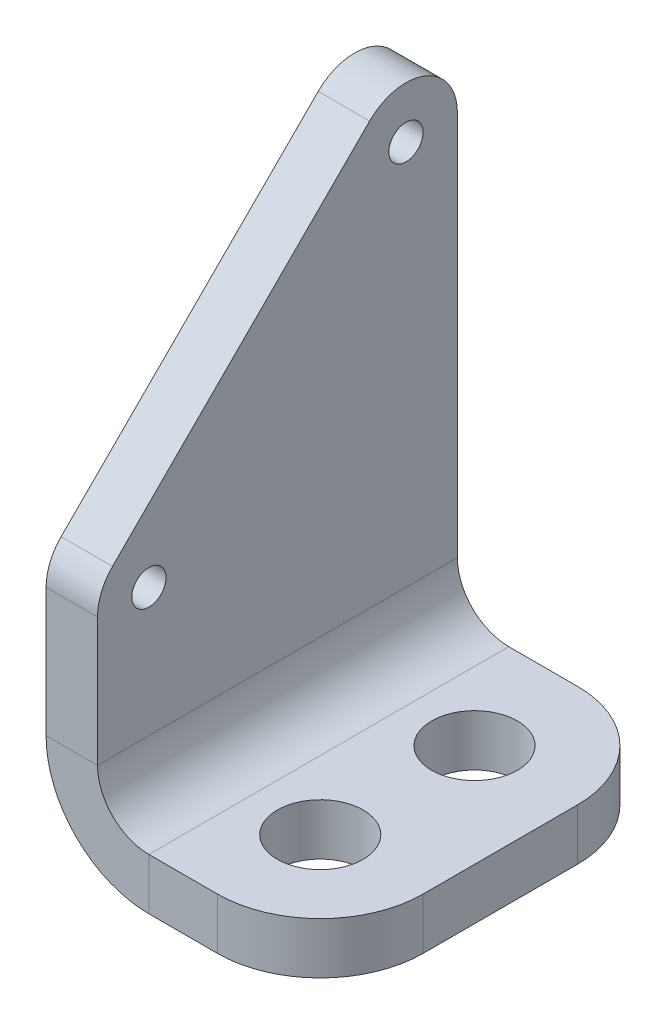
ISO-10303-21;
HEADER;
FILE_DESCRIPTION(('STEP AP214'),'2;1');
FILE_NAME('part.step','',(''),(''),'','','');
FILE_SCHEMA(('AUTOMOTIVE_DESIGN { 1 0 10303 214 1 1 1 1 }'));
ENDSEC;
DATA;
#1=APPLICATION_CONTEXT('core data for automotive mechanical design processes');
#2=APPLICATION_PROTOCOL_DEFINITION('international standard','automotive_design',2000,#1);
#3=PRODUCT_CONTEXT('',#1,'mechanical');
#4=PRODUCT('Part','Part','',(#3));
#5=PRODUCT_RELATED_PRODUCT_CATEGORY('part','',(#4));
#6=PRODUCT_DEFINITION_FORMATION('','',#4);
#7=PRODUCT_DEFINITION_CONTEXT('part definition',#1,'design');
#8=PRODUCT_DEFINITION('design','',#6,#7);
#9=PRODUCT_DEFINITION_SHAPE('','',#8);
#10=(LENGTH_UNIT() NAMED_UNIT(*) SI_UNIT(.MILLI.,.METRE.));
#11=(NAMED_UNIT(*) PLANE_ANGLE_UNIT() SI_UNIT($,.RADIAN.));
#12=(NAMED_UNIT(*) SI_UNIT($,.STERADIAN.) SOLID_ANGLE_UNIT());
#13=UNCERTAINTY_MEASURE_WITH_UNIT(LENGTH_MEASURE(1.E-05),#10,'distance_accuracy_value','');
#14=(GEOMETRIC_REPRESENTATION_CONTEXT(3) GLOBAL_UNCERTAINTY_ASSIGNED_CONTEXT((#13)) GLOBAL_UNIT_ASSIGNED_CONTEXT((#10,
#11,#12)) REPRESENTATION_CONTEXT('',''));
#15=CARTESIAN_POINT('',(0.,0.,0.));
#16=DIRECTION('',(0.,0.,1.));
#17=DIRECTION('',(1.,0.,0.));
#18=AXIS2_PLACEMENT_3D('',#15,#16,#17);
#19=CARTESIAN_POINT('',(-3.,10.5,18.));
#20=DIRECTION('',(1.,0.,0.));
#21=DIRECTION('',(0.,0.,-1.));
#22=AXIS2_PLACEMENT_3D('',#19,#20,#21);
#23=CYLINDRICAL_SURFACE('',#22,1.);
#24=CARTESIAN_POINT('',(-3.,10.5,18.));
#25=DIRECTION('',(1.,0.,0.));
#26=DIRECTION('',(0.,0.,-1.));
#27=AXIS2_PLACEMENT_3D('',#24,#25,#26);
#28=CIRCLE('',#27,1.);
#29=CARTESIAN_POINT('',(-3.,10.5,17.));
#30=VERTEX_POINT('',#29);
#31=EDGE_CURVE('E175',#30,#30,#28,.T.);
#32=ORIENTED_EDGE('',*,*,#31,.F.);
#33=EDGE_LOOP('',(#32));
#34=FACE_BOUND('',#33,.T.);
#35=CARTESIAN_POINT('',(0.,10.5,18.));
#36=DIRECTION('',(1.,0.,0.));
#37=DIRECTION('',(0.,0.,-1.));
#38=AXIS2_PLACEMENT_3D('',#35,#36,#37);
#39=CIRCLE('',#38,1.);
#40=CARTESIAN_POINT('',(0.,10.5,17.));
#41=VERTEX_POINT('',#40);
#42=EDGE_CURVE('E140',#41,#41,#39,.T.);
#43=ORIENTED_EDGE('',*,*,#42,.T.);
#44=EDGE_LOOP('',(#43));
#45=FACE_BOUND('',#44,.T.);
#46=ADVANCED_FACE('F26',(#34,#45),#23,.F.);
#47=CARTESIAN_POINT('',(-3.,0.,21.));
#48=DIRECTION('',(1.,0.,0.));
#49=DIRECTION('',(0.,0.,-1.));
#50=AXIS2_PLACEMENT_3D('',#47,#48,#49);
#51=PLANE('',#50);
#52=CARTESIAN_POINT('',(-3.,25.5,3.00000000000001));
#53=DIRECTION('',(1.,0.,0.));
#54=DIRECTION('',(0.,0.,-1.));
#55=AXIS2_PLACEMENT_3D('',#52,#53,#54);
#56=CIRCLE('',#55,1.);
#57=CARTESIAN_POINT('',(-3.,25.5,2.00000000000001));
#58=VERTEX_POINT('',#57);
#59=EDGE_CURVE('E189',#58,#58,#56,.T.);
#60=ORIENTED_EDGE('',*,*,#59,.T.);
#61=EDGE_LOOP('',(#60));
#62=FACE_BOUND('',#61,.T.);
#63=ORIENTED_EDGE('',*,*,#31,.T.);
#64=EDGE_LOOP('',(#63));
#65=FACE_BOUND('',#64,.T.);
#66=DIRECTION('',(0.,1.,0.));
#67=VECTOR('',#66,1.);
#68=CARTESIAN_POINT('',(-3.,0.,0.));
#69=LINE('',#68,#67);
#70=CARTESIAN_POINT('',(-3.,25.5,1.11022302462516E-13));
#71=VERTEX_POINT('',#70);
#72=CARTESIAN_POINT('',(-3.,3.,0.));
#73=VERTEX_POINT('',#72);
#74=EDGE_CURVE('E170',#71,#73,#69,.F.);
#75=ORIENTED_EDGE('',*,*,#74,.T.);
#76=DIRECTION('',(0.,0.,1.));
#77=VECTOR('',#76,1.);
#78=CARTESIAN_POINT('',(-3.,3.,0.));
#79=LINE('',#78,#77);
#80=CARTESIAN_POINT('',(-3.,3.,21.));
#81=VERTEX_POINT('',#80);
#82=EDGE_CURVE('E147',#73,#81,#79,.T.);
#83=ORIENTED_EDGE('',*,*,#82,.T.);
#84=DIRECTION('',(0.,1.,0.));
#85=VECTOR('',#84,1.);
#86=CARTESIAN_POINT('',(-3.,0.,21.));
#87=LINE('',#86,#85);
#88=CARTESIAN_POINT('',(-3.,10.5,21.));
#89=VERTEX_POINT('',#88);
#90=EDGE_CURVE('E153',#89,#81,#87,.F.);
#91=ORIENTED_EDGE('',*,*,#90,.F.);
#92=CARTESIAN_POINT('',(-3.,10.5,18.));
#93=DIRECTION('',(-1.,0.,0.));
#94=DIRECTION('',(0.,0.,-1.));
#95=AXIS2_PLACEMENT_3D('',#92,#93,#94);
#96=CIRCLE('',#95,2.99999999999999);
#97=CARTESIAN_POINT('',(-3.,12.6213203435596,20.1213203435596));
#98=VERTEX_POINT('',#97);
#99=EDGE_CURVE('E148',#89,#98,#96,.T.);
#100=ORIENTED_EDGE('',*,*,#99,.T.);
#101=DIRECTION('',(0.,0.707106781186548,-0.707106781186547));
#102=VECTOR('',#101,1.);
#103=CARTESIAN_POINT('',(-3.,27.6213203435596,5.12132034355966));
#104=LINE('',#103,#102);
#105=CARTESIAN_POINT('',(-3.,27.6213203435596,5.12132034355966));
#106=VERTEX_POINT('',#105);
#107=EDGE_CURVE('E171',#98,#106,#104,.T.);
#108=ORIENTED_EDGE('',*,*,#107,.T.);
#109=CARTESIAN_POINT('',(-3.,25.5,3.00000000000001));
#110=DIRECTION('',(-1.,0.,0.));
#111=DIRECTION('',(0.,0.,-1.));
#112=AXIS2_PLACEMENT_3D('',#109,#110,#111);
#113=CIRCLE('',#112,2.99999999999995);
#114=EDGE_CURVE('E167',#106,#71,#113,.T.);
#115=ORIENTED_EDGE('',*,*,#114,.T.);
#116=EDGE_LOOP('',(#75,#83,#91,#100,#108,#115));
#117=FACE_BOUND('',#116,.T.);
#118=ADVANCED_FACE('F198',(#62,#65,#117),#51,.F.);
#119=CARTESIAN_POINT('',(-3.,25.5,3.00000000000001));
#120=DIRECTION('',(1.,0.,0.));
#121=DIRECTION('',(0.,0.,-1.));
#122=AXIS2_PLACEMENT_3D('',#119,#120,#121);
#123=CYLINDRICAL_SURFACE('',#122,1.);
#124=ORIENTED_EDGE('',*,*,#59,.F.);
#125=EDGE_LOOP('',(#124));
#126=FACE_BOUND('',#125,.T.);
#127=CARTESIAN_POINT('',(0.,25.5,3.00000000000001));
#128=DIRECTION('',(1.,0.,0.));
#129=DIRECTION('',(0.,0.,-1.));
#130=AXIS2_PLACEMENT_3D('',#127,#128,#129);
#131=CIRCLE('',#130,1.);
#132=CARTESIAN_POINT('',(0.,25.5,2.00000000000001));
#133=VERTEX_POINT('',#132);
#134=EDGE_CURVE('E270',#133,#133,#131,.T.);
#135=ORIENTED_EDGE('',*,*,#134,.T.);
#136=EDGE_LOOP('',(#135));
#137=FACE_BOUND('',#136,.T.);
#138=ADVANCED_FACE('F274',(#126,#137),#123,.F.);
#139=CARTESIAN_POINT('',(0.,0.,21.));
#140=DIRECTION('',(1.,0.,0.));
#141=DIRECTION('',(0.,0.,-1.));
#142=AXIS2_PLACEMENT_3D('',#139,#140,#141);
#143=PLANE('',#142);
#144=DIRECTION('',(0.,0.,1.));
#145=VECTOR('',#144,1.);
#146=CARTESIAN_POINT('',(0.,3.,0.));
#147=LINE('',#146,#145);
#148=CARTESIAN_POINT('',(0.,3.,0.));
#149=VERTEX_POINT('',#148);
#150=CARTESIAN_POINT('',(0.,3.,21.));
#151=VERTEX_POINT('',#150);
#152=EDGE_CURVE('E130',#149,#151,#147,.T.);
#153=ORIENTED_EDGE('',*,*,#152,.F.);
#154=DIRECTION('',(0.,-1.,0.));
#155=VECTOR('',#154,1.);
#156=CARTESIAN_POINT('',(0.,0.,0.));
#157=LINE('',#156,#155);
#158=CARTESIAN_POINT('',(0.,25.5,0.));
#159=VERTEX_POINT('',#158);
#160=EDGE_CURVE('E138',#159,#149,#157,.T.);
#161=ORIENTED_EDGE('',*,*,#160,.F.);
#162=CARTESIAN_POINT('',(0.,25.5,3.00000000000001));
#163=DIRECTION('',(-1.,0.,0.));
#164=DIRECTION('',(0.,0.,-1.));
#165=AXIS2_PLACEMENT_3D('',#162,#163,#164);
#166=CIRCLE('',#165,2.99999999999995);
#167=CARTESIAN_POINT('',(0.,27.6213203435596,5.12132034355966));
#168=VERTEX_POINT('',#167);
#169=EDGE_CURVE('E41',#168,#159,#166,.T.);
#170=ORIENTED_EDGE('',*,*,#169,.F.);
#171=DIRECTION('',(0.,0.707106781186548,-0.707106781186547));
#172=VECTOR('',#171,1.);
#173=CARTESIAN_POINT('',(0.,27.6213203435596,5.12132034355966));
#174=LINE('',#173,#172);
#175=CARTESIAN_POINT('',(0.,12.6213203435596,20.1213203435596));
#176=VERTEX_POINT('',#175);
#177=EDGE_CURVE('E49',#176,#168,#174,.T.);
#178=ORIENTED_EDGE('',*,*,#177,.F.);
#179=CARTESIAN_POINT('',(0.,10.5,18.));
#180=DIRECTION('',(-1.,0.,0.));
#181=DIRECTION('',(0.,0.,-1.));
#182=AXIS2_PLACEMENT_3D('',#179,#180,#181);
#183=CIRCLE('',#182,2.99999999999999);
#184=CARTESIAN_POINT('',(0.,10.5,21.));
#185=VERTEX_POINT('',#184);
#186=EDGE_CURVE('E181',#185,#176,#183,.T.);
#187=ORIENTED_EDGE('',*,*,#186,.F.);
#188=DIRECTION('',(0.,-1.,0.));
#189=VECTOR('',#188,1.);
#190=CARTESIAN_POINT('',(0.,0.,21.));
#191=LINE('',#190,#189);
#192=EDGE_CURVE('E141',#185,#151,#191,.T.);
#193=ORIENTED_EDGE('',*,*,#192,.T.);
#194=EDGE_LOOP('',(#153,#161,#170,#178,#187,#193));
#195=FACE_BOUND('',#194,.T.);
#196=ORIENTED_EDGE('',*,*,#134,.F.);
#197=EDGE_LOOP('',(#196));
#198=FACE_BOUND('',#197,.T.);
#199=ORIENTED_EDGE('',*,*,#42,.F.);
#200=EDGE_LOOP('',(#199));
#201=FACE_BOUND('',#200,.T.);
#202=ADVANCED_FACE('F144',(#195,#198,#201),#143,.T.);
#203=CARTESIAN_POINT('',(66.0681466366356,0.,0.));
#204=DIRECTION('',(0.,0.,-1.));
#205=DIRECTION('',(0.,1.,0.));
#206=AXIS2_PLACEMENT_3D('',#203,#204,#205);
#207=PLANE('',#206);
#208=ORIENTED_EDGE('',*,*,#74,.F.);
#209=DIRECTION('',(-1.,0.,0.));
#210=VECTOR('',#209,1.);
#211=CARTESIAN_POINT('',(66.0681466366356,25.5,0.));
#212=LINE('',#211,#210);
#213=EDGE_CURVE('E34',#159,#71,#212,.T.);
#214=ORIENTED_EDGE('',*,*,#213,.F.);
#215=ORIENTED_EDGE('',*,*,#160,.T.);
#216=DIRECTION('',(-1.,0.,0.));
#217=VECTOR('',#216,1.);
#218=CARTESIAN_POINT('',(66.0681466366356,3.,0.));
#219=LINE('',#218,#217);
#220=EDGE_CURVE('E11',#149,#73,#219,.T.);
#221=ORIENTED_EDGE('',*,*,#220,.T.);
#222=EDGE_LOOP('',(#208,#214,#215,#221));
#223=FACE_BOUND('',#222,.T.);
#224=ADVANCED_FACE('F28',(#223),#207,.T.);
#225=CARTESIAN_POINT('',(66.0681466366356,25.5,3.00000000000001));
#226=DIRECTION('',(-1.,0.,0.));
#227=DIRECTION('',(0.,-1.,0.));
#228=AXIS2_PLACEMENT_3D('',#225,#226,#227);
#229=CYLINDRICAL_SURFACE('',#228,2.99999999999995);
#230=ORIENTED_EDGE('',*,*,#114,.F.);
#231=DIRECTION('',(-1.,0.,0.));
#232=VECTOR('',#231,1.);
#233=CARTESIAN_POINT('',(66.0681466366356,27.6213203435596,5.12132034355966));
#234=LINE('',#233,#232);
#235=EDGE_CURVE('E164',#168,#106,#234,.T.);
#236=ORIENTED_EDGE('',*,*,#235,.F.);
#237=ORIENTED_EDGE('',*,*,#169,.T.);
#238=ORIENTED_EDGE('',*,*,#213,.T.);
#239=EDGE_LOOP('',(#230,#236,#237,#238));
#240=FACE_BOUND('',#239,.T.);
#241=ADVANCED_FACE('F166',(#240),#229,.T.);
#242=CARTESIAN_POINT('',(66.0681466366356,27.6213203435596,5.12132034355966));
#243=DIRECTION('',(0.,0.707106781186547,0.707106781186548));
#244=DIRECTION('',(0.,-0.707106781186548,0.707106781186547));
#245=AXIS2_PLACEMENT_3D('',#242,#243,#244);
#246=PLANE('',#245);
#247=ORIENTED_EDGE('',*,*,#107,.F.);
#248=DIRECTION('',(-1.,0.,0.));
#249=VECTOR('',#248,1.);
#250=CARTESIAN_POINT('',(66.0681466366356,12.6213203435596,20.1213203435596));
#251=LINE('',#250,#249);
#252=EDGE_CURVE('E161',#176,#98,#251,.T.);
#253=ORIENTED_EDGE('',*,*,#252,.F.);
#254=ORIENTED_EDGE('',*,*,#177,.T.);
#255=ORIENTED_EDGE('',*,*,#235,.T.);
#256=EDGE_LOOP('',(#247,#253,#254,#255));
#257=FACE_BOUND('',#256,.T.);
#258=ADVANCED_FACE('F174',(#257),#246,.T.);
#259=CARTESIAN_POINT('',(66.0681466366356,10.5,18.));
#260=DIRECTION('',(-1.,0.,0.));
#261=DIRECTION('',(0.,-1.,0.));
#262=AXIS2_PLACEMENT_3D('',#259,#260,#261);
#263=CYLINDRICAL_SURFACE('',#262,2.99999999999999);
#264=ORIENTED_EDGE('',*,*,#99,.F.);
#265=DIRECTION('',(-1.,0.,0.));
#266=VECTOR('',#265,1.);
#267=CARTESIAN_POINT('',(66.0681466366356,10.5,21.));
#268=LINE('',#267,#266);
#269=EDGE_CURVE('E158',#185,#89,#268,.T.);
#270=ORIENTED_EDGE('',*,*,#269,.F.);
#271=ORIENTED_EDGE('',*,*,#186,.T.);
#272=ORIENTED_EDGE('',*,*,#252,.T.);
#273=EDGE_LOOP('',(#264,#270,#271,#272));
#274=FACE_BOUND('',#273,.T.);
#275=ADVANCED_FACE('F179',(#274),#263,.T.);
#276=CARTESIAN_POINT('',(66.0681466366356,0.,21.));
#277=DIRECTION('',(0.,0.,-1.));
#278=DIRECTION('',(0.,1.,0.));
#279=AXIS2_PLACEMENT_3D('',#276,#277,#278);
#280=PLANE('',#279);
#281=ORIENTED_EDGE('',*,*,#269,.T.);
#282=ORIENTED_EDGE('',*,*,#90,.T.);
#283=DIRECTION('',(-1.,0.,0.));
#284=VECTOR('',#283,1.);
#285=CARTESIAN_POINT('',(66.0681466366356,3.,21.));
#286=LINE('',#285,#284);
#287=EDGE_CURVE('E151',#151,#81,#286,.T.);
#288=ORIENTED_EDGE('',*,*,#287,.F.);
#289=ORIENTED_EDGE('',*,*,#192,.F.);
#290=EDGE_LOOP('',(#281,#282,#288,#289));
#291=FACE_BOUND('',#290,.T.);
#292=ADVANCED_FACE('F197',(#291),#280,.F.);
#293=CARTESIAN_POINT('',(0.,-3.,21.));
#294=DIRECTION('',(0.,1.,0.));
#295=DIRECTION('',(0.,0.,1.));
#296=AXIS2_PLACEMENT_3D('',#293,#294,#295);
#297=PLANE('',#296);
#298=CARTESIAN_POINT('',(6.99999999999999,-3.,6.));
#299=DIRECTION('',(0.,1.,0.));
#300=DIRECTION('',(0.,0.,1.));
#301=AXIS2_PLACEMENT_3D('',#298,#299,#300);
#302=CIRCLE('',#301,2.5);
#303=CARTESIAN_POINT('',(6.99999999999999,-3.,8.5));
#304=VERTEX_POINT('',#303);
#305=EDGE_CURVE('E236',#304,#304,#302,.T.);
#306=ORIENTED_EDGE('',*,*,#305,.T.);
#307=EDGE_LOOP('',(#306));
#308=FACE_BOUND('',#307,.T.);
#309=CARTESIAN_POINT('',(6.99999999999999,-3.,15.));
#310=DIRECTION('',(0.,1.,0.));
#311=DIRECTION('',(0.,0.,-1.));
#312=AXIS2_PLACEMENT_3D('',#309,#310,#311);
#313=CIRCLE('',#312,2.5);
#314=CARTESIAN_POINT('',(6.99999999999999,-3.,12.5));
#315=VERTEX_POINT('',#314);
#316=EDGE_CURVE('E233',#315,#315,#313,.T.);
#317=ORIENTED_EDGE('',*,*,#316,.T.);
#318=EDGE_LOOP('',(#317));
#319=FACE_BOUND('',#318,.T.);
#320=DIRECTION('',(0.,0.,1.));
#321=VECTOR('',#320,1.);
#322=CARTESIAN_POINT('',(3.,-3.,0.));
#323=LINE('',#322,#321);
#324=CARTESIAN_POINT('',(3.,-3.,0.));
#325=VERTEX_POINT('',#324);
#326=CARTESIAN_POINT('',(3.,-3.,21.));
#327=VERTEX_POINT('',#326);
#328=EDGE_CURVE('E205',#325,#327,#323,.T.);
#329=ORIENTED_EDGE('',*,*,#328,.F.);
#330=DIRECTION('',(1.,0.,0.));
#331=VECTOR('',#330,1.);
#332=CARTESIAN_POINT('',(0.,-3.,0.));
#333=LINE('',#332,#331);
#334=CARTESIAN_POINT('',(7.,-3.,0.));
#335=VERTEX_POINT('',#334);
#336=EDGE_CURVE('E239',#325,#335,#333,.T.);
#337=ORIENTED_EDGE('',*,*,#336,.T.);
#338=CARTESIAN_POINT('',(7.,-3.,6.));
#339=DIRECTION('',(0.,1.,0.));
#340=DIRECTION('',(0.,0.,1.));
#341=AXIS2_PLACEMENT_3D('',#338,#339,#340);
#342=CIRCLE('',#341,6.);
#343=CARTESIAN_POINT('',(13.,-3.,6.));
#344=VERTEX_POINT('',#343);
#345=EDGE_CURVE('E241',#335,#344,#342,.F.);
#346=ORIENTED_EDGE('',*,*,#345,.T.);
#347=DIRECTION('',(0.,0.,-1.));
#348=VECTOR('',#347,1.);
#349=CARTESIAN_POINT('',(13.,-3.,21.));
#350=LINE('',#349,#348);
#351=CARTESIAN_POINT('',(13.,-3.,15.));
#352=VERTEX_POINT('',#351);
#353=EDGE_CURVE('E243',#352,#344,#350,.T.);
#354=ORIENTED_EDGE('',*,*,#353,.F.);
#355=CARTESIAN_POINT('',(7.,-3.,15.));
#356=DIRECTION('',(0.,1.,0.));
#357=DIRECTION('',(0.,0.,1.));
#358=AXIS2_PLACEMENT_3D('',#355,#356,#357);
#359=CIRCLE('',#358,6.);
#360=CARTESIAN_POINT('',(7.,-3.,21.));
#361=VERTEX_POINT('',#360);
#362=EDGE_CURVE('E246',#352,#361,#359,.F.);
#363=ORIENTED_EDGE('',*,*,#362,.T.);
#364=DIRECTION('',(1.,0.,0.));
#365=VECTOR('',#364,1.);
#366=CARTESIAN_POINT('',(0.,-3.,21.));
#367=LINE('',#366,#365);
#368=EDGE_CURVE('E248',#327,#361,#367,.T.);
#369=ORIENTED_EDGE('',*,*,#368,.F.);
#370=EDGE_LOOP('',(#329,#337,#346,#354,#363,#369));
#371=FACE_BOUND('',#370,.T.);
#372=ADVANCED_FACE('F301',(#308,#319,#371),#297,.F.);
#373=CARTESIAN_POINT('',(0.,0.,21.));
#374=DIRECTION('',(0.,1.,0.));
#375=DIRECTION('',(0.,0.,1.));
#376=AXIS2_PLACEMENT_3D('',#373,#374,#375);
#377=PLANE('',#376);
#378=CARTESIAN_POINT('',(6.99999999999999,0.,6.));
#379=DIRECTION('',(0.,1.,0.));
#380=DIRECTION('',(0.,0.,1.));
#381=AXIS2_PLACEMENT_3D('',#378,#379,#380);
#382=CIRCLE('',#381,2.5);
#383=CARTESIAN_POINT('',(6.99999999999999,0.,8.5));
#384=VERTEX_POINT('',#383);
#385=EDGE_CURVE('E211',#384,#384,#382,.T.);
#386=ORIENTED_EDGE('',*,*,#385,.F.);
#387=EDGE_LOOP('',(#386));
#388=FACE_BOUND('',#387,.T.);
#389=CARTESIAN_POINT('',(6.99999999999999,0.,15.));
#390=DIRECTION('',(0.,1.,0.));
#391=DIRECTION('',(0.,0.,-1.));
#392=AXIS2_PLACEMENT_3D('',#389,#390,#391);
#393=CIRCLE('',#392,2.5);
#394=CARTESIAN_POINT('',(6.99999999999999,0.,12.5));
#395=VERTEX_POINT('',#394);
#396=EDGE_CURVE('E208',#395,#395,#393,.T.);
#397=ORIENTED_EDGE('',*,*,#396,.F.);
#398=EDGE_LOOP('',(#397));
#399=FACE_BOUND('',#398,.T.);
#400=DIRECTION('',(1.,0.,0.));
#401=VECTOR('',#400,1.);
#402=CARTESIAN_POINT('',(0.,0.,0.));
#403=LINE('',#402,#401);
#404=CARTESIAN_POINT('',(3.,0.,0.));
#405=VERTEX_POINT('',#404);
#406=CARTESIAN_POINT('',(7.,0.,0.));
#407=VERTEX_POINT('',#406);
#408=EDGE_CURVE('E224',#405,#407,#403,.T.);
#409=ORIENTED_EDGE('',*,*,#408,.F.);
#410=DIRECTION('',(0.,0.,1.));
#411=VECTOR('',#410,1.);
#412=CARTESIAN_POINT('',(3.,0.,0.));
#413=LINE('',#412,#411);
#414=CARTESIAN_POINT('',(3.,0.,21.));
#415=VERTEX_POINT('',#414);
#416=EDGE_CURVE('E133',#405,#415,#413,.T.);
#417=ORIENTED_EDGE('',*,*,#416,.T.);
#418=DIRECTION('',(1.,0.,0.));
#419=VECTOR('',#418,1.);
#420=CARTESIAN_POINT('',(0.,0.,21.));
#421=LINE('',#420,#419);
#422=CARTESIAN_POINT('',(7.,0.,21.));
#423=VERTEX_POINT('',#422);
#424=EDGE_CURVE('E227',#415,#423,#421,.T.);
#425=ORIENTED_EDGE('',*,*,#424,.T.);
#426=CARTESIAN_POINT('',(7.,0.,15.));
#427=DIRECTION('',(0.,1.,0.));
#428=DIRECTION('',(0.,0.,1.));
#429=AXIS2_PLACEMENT_3D('',#426,#427,#428);
#430=CIRCLE('',#429,6.);
#431=CARTESIAN_POINT('',(13.,0.,15.));
#432=VERTEX_POINT('',#431);
#433=EDGE_CURVE('E230',#423,#432,#430,.T.);
#434=ORIENTED_EDGE('',*,*,#433,.T.);
#435=DIRECTION('',(0.,0.,-1.));
#436=VECTOR('',#435,1.);
#437=CARTESIAN_POINT('',(13.,0.,21.));
#438=LINE('',#437,#436);
#439=CARTESIAN_POINT('',(13.,0.,6.));
#440=VERTEX_POINT('',#439);
#441=EDGE_CURVE('E218',#432,#440,#438,.T.);
#442=ORIENTED_EDGE('',*,*,#441,.T.);
#443=CARTESIAN_POINT('',(7.,0.,6.));
#444=DIRECTION('',(0.,1.,0.));
#445=DIRECTION('',(0.,0.,1.));
#446=AXIS2_PLACEMENT_3D('',#443,#444,#445);
#447=CIRCLE('',#446,6.);
#448=EDGE_CURVE('E221',#440,#407,#447,.T.);
#449=ORIENTED_EDGE('',*,*,#448,.T.);
#450=EDGE_LOOP('',(#409,#417,#425,#434,#442,#449));
#451=FACE_BOUND('',#450,.T.);
#452=ADVANCED_FACE('F305',(#388,#399,#451),#377,.T.);
#453=CARTESIAN_POINT('',(6.99999999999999,-3.,6.));
#454=DIRECTION('',(0.,1.,0.));
#455=DIRECTION('',(0.,0.,1.));
#456=AXIS2_PLACEMENT_3D('',#453,#454,#455);
#457=CYLINDRICAL_SURFACE('',#456,2.5);
#458=ORIENTED_EDGE('',*,*,#305,.F.);
#459=EDGE_LOOP('',(#458));
#460=FACE_BOUND('',#459,.T.);
#461=ORIENTED_EDGE('',*,*,#385,.T.);
#462=EDGE_LOOP('',(#461));
#463=FACE_BOUND('',#462,.T.);
#464=ADVANCED_FACE('F311',(#460,#463),#457,.F.);
#465=CARTESIAN_POINT('',(6.99999999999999,-3.,15.));
#466=DIRECTION('',(0.,1.,0.));
#467=DIRECTION('',(0.,0.,1.));
#468=AXIS2_PLACEMENT_3D('',#465,#466,#467);
#469=CYLINDRICAL_SURFACE('',#468,2.5);
#470=ORIENTED_EDGE('',*,*,#316,.F.);
#471=EDGE_LOOP('',(#470));
#472=FACE_BOUND('',#471,.T.);
#473=ORIENTED_EDGE('',*,*,#396,.T.);
#474=EDGE_LOOP('',(#473));
#475=FACE_BOUND('',#474,.T.);
#476=ADVANCED_FACE('F314',(#472,#475),#469,.F.);
#477=CARTESIAN_POINT('',(0.,46.518813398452,0.));
#478=DIRECTION('',(0.,0.,-1.));
#479=DIRECTION('',(-1.,0.,0.));
#480=AXIS2_PLACEMENT_3D('',#477,#478,#479);
#481=PLANE('',#480);
#482=ORIENTED_EDGE('',*,*,#336,.F.);
#483=DIRECTION('',(0.,-1.,0.));
#484=VECTOR('',#483,1.);
#485=CARTESIAN_POINT('',(3.,46.518813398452,0.));
#486=LINE('',#485,#484);
#487=EDGE_CURVE('E268',#405,#325,#486,.T.);
#488=ORIENTED_EDGE('',*,*,#487,.F.);
#489=ORIENTED_EDGE('',*,*,#408,.T.);
#490=DIRECTION('',(0.,-1.,0.));
#491=VECTOR('',#490,1.);
#492=CARTESIAN_POINT('',(7.,46.518813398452,0.));
#493=LINE('',#492,#491);
#494=EDGE_CURVE('E253',#407,#335,#493,.T.);
#495=ORIENTED_EDGE('',*,*,#494,.T.);
#496=EDGE_LOOP('',(#482,#488,#489,#495));
#497=FACE_BOUND('',#496,.T.);
#498=ADVANCED_FACE('F321',(#497),#481,.T.);
#499=CARTESIAN_POINT('',(0.,46.518813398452,21.));
#500=DIRECTION('',(0.,0.,-1.));
#501=DIRECTION('',(-1.,0.,0.));
#502=AXIS2_PLACEMENT_3D('',#499,#500,#501);
#503=PLANE('',#502);
#504=DIRECTION('',(0.,-1.,0.));
#505=VECTOR('',#504,1.);
#506=CARTESIAN_POINT('',(3.,46.518813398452,21.));
#507=LINE('',#506,#505);
#508=EDGE_CURVE('E265',#415,#327,#507,.T.);
#509=ORIENTED_EDGE('',*,*,#508,.T.);
#510=ORIENTED_EDGE('',*,*,#368,.T.);
#511=DIRECTION('',(0.,-1.,0.));
#512=VECTOR('',#511,1.);
#513=CARTESIAN_POINT('',(7.,46.518813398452,21.));
#514=LINE('',#513,#512);
#515=EDGE_CURVE('E262',#423,#361,#514,.T.);
#516=ORIENTED_EDGE('',*,*,#515,.F.);
#517=ORIENTED_EDGE('',*,*,#424,.F.);
#518=EDGE_LOOP('',(#509,#510,#516,#517));
#519=FACE_BOUND('',#518,.T.);
#520=ADVANCED_FACE('F334',(#519),#503,.F.);
#521=CARTESIAN_POINT('',(7.,46.518813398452,15.));
#522=DIRECTION('',(0.,-1.,0.));
#523=DIRECTION('',(0.,0.,-1.));
#524=AXIS2_PLACEMENT_3D('',#521,#522,#523);
#525=CYLINDRICAL_SURFACE('',#524,6.);
#526=ORIENTED_EDGE('',*,*,#515,.T.);
#527=ORIENTED_EDGE('',*,*,#362,.F.);
#528=DIRECTION('',(0.,-1.,0.));
#529=VECTOR('',#528,1.);
#530=CARTESIAN_POINT('',(13.,46.518813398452,15.));
#531=LINE('',#530,#529);
#532=EDGE_CURVE('E259',#432,#352,#531,.T.);
#533=ORIENTED_EDGE('',*,*,#532,.F.);
#534=ORIENTED_EDGE('',*,*,#433,.F.);
#535=EDGE_LOOP('',(#526,#527,#533,#534));
#536=FACE_BOUND('',#535,.T.);
#537=ADVANCED_FACE('F330',(#536),#525,.T.);
#538=CARTESIAN_POINT('',(13.,46.518813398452,21.));
#539=DIRECTION('',(-1.,0.,0.));
#540=DIRECTION('',(0.,0.,1.));
#541=AXIS2_PLACEMENT_3D('',#538,#539,#540);
#542=PLANE('',#541);
#543=ORIENTED_EDGE('',*,*,#532,.T.);
#544=ORIENTED_EDGE('',*,*,#353,.T.);
#545=DIRECTION('',(0.,-1.,0.));
#546=VECTOR('',#545,1.);
#547=CARTESIAN_POINT('',(13.,46.518813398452,6.));
#548=LINE('',#547,#546);
#549=EDGE_CURVE('E256',#440,#344,#548,.T.);
#550=ORIENTED_EDGE('',*,*,#549,.F.);
#551=ORIENTED_EDGE('',*,*,#441,.F.);
#552=EDGE_LOOP('',(#543,#544,#550,#551));
#553=FACE_BOUND('',#552,.T.);
#554=ADVANCED_FACE('F326',(#553),#542,.F.);
#555=CARTESIAN_POINT('',(7.,46.518813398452,6.));
#556=DIRECTION('',(0.,-1.,0.));
#557=DIRECTION('',(0.,0.,-1.));
#558=AXIS2_PLACEMENT_3D('',#555,#556,#557);
#559=CYLINDRICAL_SURFACE('',#558,6.);
#560=ORIENTED_EDGE('',*,*,#549,.T.);
#561=ORIENTED_EDGE('',*,*,#345,.F.);
#562=ORIENTED_EDGE('',*,*,#494,.F.);
#563=ORIENTED_EDGE('',*,*,#448,.F.);
#564=EDGE_LOOP('',(#560,#561,#562,#563));
#565=FACE_BOUND('',#564,.T.);
#566=ADVANCED_FACE('F322',(#565),#559,.T.);
#567=CARTESIAN_POINT('',(3.,3.,21.));
#568=DIRECTION('',(0.,0.,1.));
#569=DIRECTION('',(1.,0.,0.));
#570=AXIS2_PLACEMENT_3D('',#567,#568,#569);
#571=PLANE('',#570);
#572=ORIENTED_EDGE('',*,*,#508,.F.);
#573=CARTESIAN_POINT('',(3.,3.,21.));
#574=DIRECTION('',(0.,0.,1.));
#575=DIRECTION('',(1.,0.,0.));
#576=AXIS2_PLACEMENT_3D('',#573,#574,#575);
#577=CIRCLE('',#576,3.);
#578=EDGE_CURVE('E135',#415,#151,#577,.F.);
#579=ORIENTED_EDGE('',*,*,#578,.T.);
#580=ORIENTED_EDGE('',*,*,#287,.T.);
#581=CARTESIAN_POINT('',(3.,3.,21.));
#582=DIRECTION('',(0.,0.,1.));
#583=DIRECTION('',(1.,0.,0.));
#584=AXIS2_PLACEMENT_3D('',#581,#582,#583);
#585=CIRCLE('',#584,6.);
#586=EDGE_CURVE('E204',#327,#81,#585,.F.);
#587=ORIENTED_EDGE('',*,*,#586,.F.);
#588=EDGE_LOOP('',(#572,#579,#580,#587));
#589=FACE_BOUND('',#588,.T.);
#590=ADVANCED_FACE('F325',(#589),#571,.T.);
#591=CARTESIAN_POINT('',(3.,3.,0.));
#592=DIRECTION('',(0.,0.,-1.));
#593=DIRECTION('',(-1.,0.,0.));
#594=AXIS2_PLACEMENT_3D('',#591,#592,#593);
#595=PLANE('',#594);
#596=ORIENTED_EDGE('',*,*,#220,.F.);
#597=CARTESIAN_POINT('',(3.,3.,0.));
#598=DIRECTION('',(0.,0.,1.));
#599=DIRECTION('',(1.,0.,0.));
#600=AXIS2_PLACEMENT_3D('',#597,#598,#599);
#601=CIRCLE('',#600,3.);
#602=EDGE_CURVE('E118',#149,#405,#601,.T.);
#603=ORIENTED_EDGE('',*,*,#602,.T.);
#604=ORIENTED_EDGE('',*,*,#487,.T.);
#605=CARTESIAN_POINT('',(3.,3.,0.));
#606=DIRECTION('',(0.,0.,1.));
#607=DIRECTION('',(1.,0.,0.));
#608=AXIS2_PLACEMENT_3D('',#605,#606,#607);
#609=CIRCLE('',#608,6.);
#610=EDGE_CURVE('E121',#73,#325,#609,.T.);
#611=ORIENTED_EDGE('',*,*,#610,.F.);
#612=EDGE_LOOP('',(#596,#603,#604,#611));
#613=FACE_BOUND('',#612,.T.);
#614=ADVANCED_FACE('F117',(#613),#595,.T.);
#615=CARTESIAN_POINT('',(3.,3.,-47.5613740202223));
#616=DIRECTION('',(0.,0.,1.));
#617=DIRECTION('',(1.,0.,0.));
#618=AXIS2_PLACEMENT_3D('',#615,#616,#617);
#619=CYLINDRICAL_SURFACE('',#618,6.);
#620=ORIENTED_EDGE('',*,*,#610,.T.);
#621=ORIENTED_EDGE('',*,*,#328,.T.);
#622=ORIENTED_EDGE('',*,*,#586,.T.);
#623=ORIENTED_EDGE('',*,*,#82,.F.);
#624=EDGE_LOOP('',(#620,#621,#622,#623));
#625=FACE_BOUND('',#624,.T.);
#626=ADVANCED_FACE('F201',(#625),#619,.T.);
#627=CARTESIAN_POINT('',(3.,3.,-47.5613740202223));
#628=DIRECTION('',(0.,0.,1.));
#629=DIRECTION('',(1.,0.,0.));
#630=AXIS2_PLACEMENT_3D('',#627,#628,#629);
#631=CYLINDRICAL_SURFACE('',#630,3.);
#632=ORIENTED_EDGE('',*,*,#602,.F.);
#633=ORIENTED_EDGE('',*,*,#152,.T.);
#634=ORIENTED_EDGE('',*,*,#578,.F.);
#635=ORIENTED_EDGE('',*,*,#416,.F.);
#636=EDGE_LOOP('',(#632,#633,#634,#635));
#637=FACE_BOUND('',#636,.T.);
#638=ADVANCED_FACE('F127',(#637),#631,.F.);
#639=CLOSED_SHELL('',(#46,#118,#138,#202,#224,#241,#258,#275,#292,#372,#452,#464,#476,#498,#520,
#537,#554,#566,#590,#614,#626,#638));
#640=MANIFOLD_SOLID_BREP('B2',#639);
#641=ADVANCED_BREP_SHAPE_REPRESENTATION('',(#18,#640),#14);
#642=SHAPE_DEFINITION_REPRESENTATION(#9,#641);
ENDSEC;
END-ISO-10303-21;
